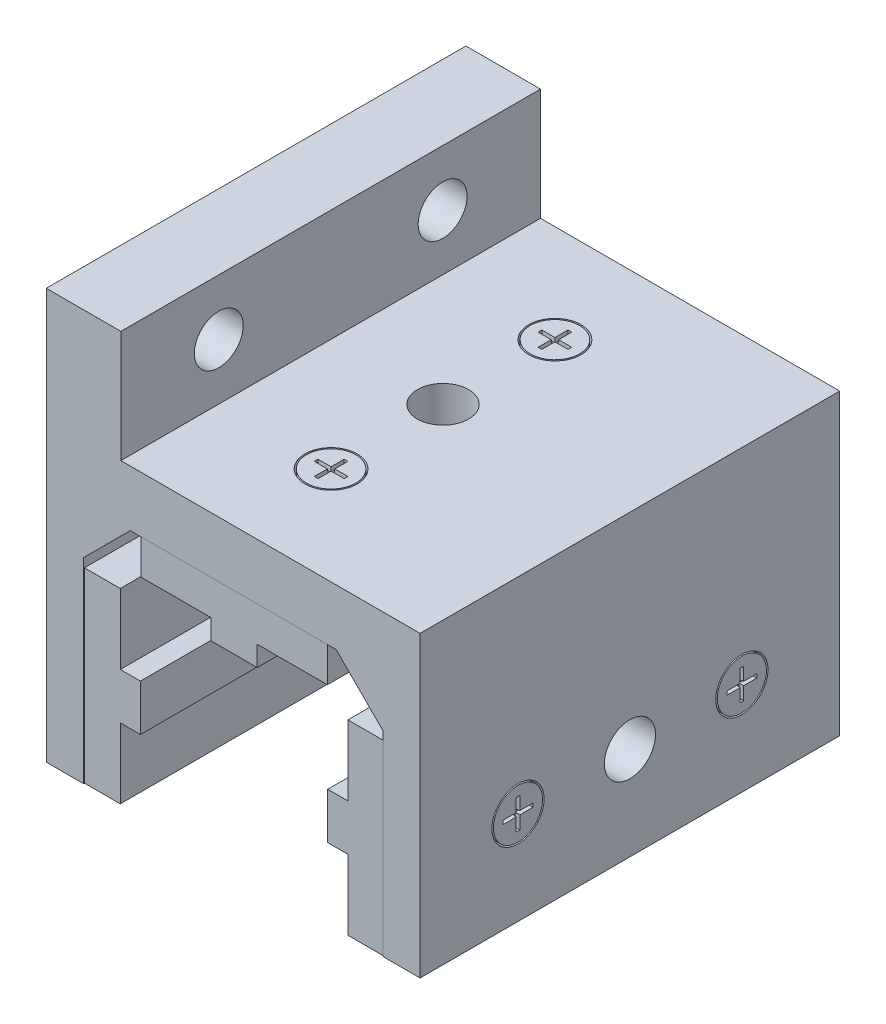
from build123d import *

# Parameters (mm, degrees)
BOSS_EXTRUDE1_DEPTH       = 35.7124
BOSS_EXTRUDE2_DEPTH       = 35.56
BOSS_EXTRUDE2_2_DEPTH     = 35.56
SKETCH11_W                = 7.874
SKETCH11_H                = 7.874
CUT_EXTRUDE5_DEPTH        = 79.334341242
SKETCH12_W                = 7.874
SKETCH12_H                = 7.874
CUT_EXTRUDE6_DEPTH        = 58.406766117
SKETCH3_R                 = 4.445
SKETCH3_R_2               = 4.191
CUT_EXTRUDE1_DEPTH        = 4.7625
CUT_EXTRUDE2_DEPTH        = 0.762
CUT_EXTRUDE2_DRAFT        = -5
SKETCH13_R                = 4.445
SKETCH13_R_2              = 4.191
CUT_EXTRUDE_THIN1_DEPTH   = 3.175
CUT_EXTRUDE7_DEPTH        = 0.762
CUT_EXTRUDE7_DRAFT        = -5
MIRROR4_COPY_1_DEPTH      = 0.762
MIRROR4_COPY_1_DRAFT      = -5
MIRROR3_COPY_1_DEPTH      = 0.762
MIRROR3_COPY_1_DRAFT      = -5
MIRROR3_COPY_2_DEPTH      = 0.762
MIRROR3_COPY_2_DRAFT      = -5
MIRROR3_COPY_3_SKETCH_R   = 4.445
MIRROR3_COPY_3_SKETCH_R_2 = 4.191
MIRROR3_COPY_3_DEPTH      = 3.175
MIRROR3_COPY_4_DEPTH      = 0.762
MIRROR3_COPY_4_DRAFT      = -5
SKETCH9_R                 = 4.3561
CUT_EXTRUDE4_DEPTH        = 70.771873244
CUT_EXTRUDE8_DEPTH        = 70.771873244
CUT_EXTRUDE8_DEPTH_BACK   = 70.771873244
SKETCH15_R                = 4.3561
SIDE_START                = -35.7124
SKETCH6_W                 = 12.7
SKETCH6_H                 = 28.575
SIDE_FLANGE_DEPTH         = 71.4248
SKETCH7_R                 = 4.1656
SIDE_FLANGE_HOLE_DEPTH    = 85.655164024
TOP_FLANGE_DEPTH          = 35.7124
TOP_FLANGE_DEPTH_BACK     = 35.7124
SKETCH16_W                = 3.175
SKETCH16_H                = 9.525


with BuildPart() as part:
    # Sketch1 → Boss-Extrude1 (new, symmetric)
    with BuildSketch(Plane.XY):
        Polygon((-25.4635, 0), (-25.4635, 33.3248), (-17.5133, 41.275), (17.5133, 41.275), (25.4635, 33.3248), (25.4635, 0), (31.8135, 0), (31.8135, 50.8), (-31.8135, 50.8), (-31.8135, 0), align=None)
    extrude(amount=BOSS_EXTRUDE1_DEPTH, both=True)

    # Sketch3 → Cut-Extrude1 (cut)
    with BuildSketch(Plane(origin=(0, 50.8, 0), x_dir=(1, 0, 0), z_dir=(0, 1, 0))):
        with Locations(Location((0, -19.05, 0), (0, 0, 270))):
            Circle(SKETCH3_R)
        with Locations(Location((0, -19.05, 0), (0, 0, 270))):
            Circle(SKETCH3_R_2, mode=Mode.SUBTRACT)
    cut_extrude1 = extrude(amount=-CUT_EXTRUDE1_DEPTH, mode=Mode.SUBTRACT)


with BuildPart() as body_2:
    # Sketch2 → Boss-Extrude2 (new, symmetric)
    with BuildSketch(Plane.XY):
        Polygon((-19.3675, 19.812), (-19.3675, 31.75), (-25.4635, 31.75), (-25.4635, 0), (-19.3675, 0), (-19.3675, 11.938), (-15.9385, 11.938), (-15.9385, 19.812), align=None)
    extrude(amount=BOSS_EXTRUDE2_DEPTH, both=True)

    # Sketch11 → Cut-Extrude5 (cut, through all)
    with BuildSketch(Plane(origin=(-15.9385, 0, 0), x_dir=(0, 0, -1), z_dir=(1, 0, 0))):
        with Locations((0, 15.875)):
            Rectangle(SKETCH11_W, SKETCH11_H)
    extrude(amount=-CUT_EXTRUDE5_DEPTH, mode=Mode.SUBTRACT)


with BuildPart() as body_3:
    # Sketch2 → Boss-Extrude2 2 (new, symmetric)
    with BuildSketch(Plane.XY):
        Polygon((-15.875, 41.275), (15.875, 41.275), (15.875, 35.179), (3.937, 35.179), (3.937, 31.75), (-3.937, 31.75), (-3.937, 35.179), (-15.875, 35.179), align=None)
    extrude(amount=BOSS_EXTRUDE2_2_DEPTH, both=True)

    # Sketch12 → Cut-Extrude6 (cut, through all)
    with BuildSketch(Plane.XZ.offset(-31.75)):
        Rectangle(SKETCH12_W, SKETCH12_H)
    extrude(amount=-CUT_EXTRUDE6_DEPTH, mode=Mode.SUBTRACT)


with BuildPart() as body_4:
    # Mirror1: mirrored copy
    add(body_2.part.mirror(Plane(origin=(0, 0, 0), x_dir=(0, 0, 1), z_dir=(1, 0, 0))))


with BuildPart() as cut_extrude2_tool:
    # Sketch5 → Cut-Extrude2 (with draft: the straight prism first)
    with BuildSketch(Plane(origin=(0, 50.8, 0), x_dir=(1, 0, 0), z_dir=(0, 1, 0))):
        Polygon((0.3175, -18.7325), (0.3175, -16.51), (-0.3175, -16.51), (-0.3175, -18.7325), (-2.54, -18.7325), (-2.54, -19.3675), (-0.3175, -19.3675), (-0.3175, -21.59), (0.3175, -21.59), (0.3175, -19.3675), (2.54, -19.3675), (2.54, -18.7325), align=None)
    extrude(amount=-CUT_EXTRUDE2_DEPTH)
    # Cut-Extrude2: the draft: its side faces are tilted about the plane it starts from
    cut_extrude2_sides = [cut_extrude2_tool.faces().sort_by_distance(p)[0] for p in [
        (0.3175, 50.419, 17.62125),
        (0, 50.419, 16.51),
        (-0.3175, 50.419, 17.62125),
        (-1.42875, 50.419, 18.7325),
        (-2.54, 50.419, 19.05),
        (-1.42875, 50.419, 19.3675),
        (-0.3175, 50.419, 20.47875),
        (0, 50.419, 21.59),
        (0.3175, 50.419, 20.47875),
        (1.42875, 50.419, 19.3675),
        (2.54, 50.419, 19.05),
        (1.42875, 50.419, 18.7325),
    ]]
    draft(cut_extrude2_sides, Plane(origin=(0, 50.8, 0), x_dir=(1, 0, 0), z_dir=(0, 1, 0)), CUT_EXTRUDE2_DRAFT)


with BuildPart() as part_1:
    add(part.part)

    # Cut-Extrude2: cut by cut_extrude2_tool
    add(cut_extrude2_tool.part, mode=Mode.SUBTRACT)

    # Sketch13 → Cut-Extrude-Thin1 (cut)
    with BuildSketch(Plane(origin=(31.8135, 0, 0), x_dir=(0, 0, -1), z_dir=(1, 0, 0))):
        with Locations((-19.05, 15.875)):
            Circle(SKETCH13_R)
        with Locations((-19.05, 15.875)):
            Circle(SKETCH13_R_2, mode=Mode.SUBTRACT)
    cut_extrude_thin1 = extrude(amount=-CUT_EXTRUDE_THIN1_DEPTH, mode=Mode.SUBTRACT)


with BuildPart() as cut_extrude7_tool:
    # Sketch14 → Cut-Extrude7 (with draft: the straight prism first)
    with BuildSketch(Plane(origin=(31.8135, 0, 0), x_dir=(0, 0, -1), z_dir=(1, 0, 0))):
        Polygon((-19.3675, 15.5575), (-19.3675, 13.335), (-18.7325, 13.335), (-18.7325, 15.5575), (-16.51, 15.5575), (-16.51, 16.1925), (-18.7325, 16.1925), (-18.7325, 18.415), (-19.3675, 18.415), (-19.3675, 16.1925), (-21.59, 16.1925), (-21.59, 15.5575), align=None)
    extrude(amount=-CUT_EXTRUDE7_DEPTH)
    # Cut-Extrude7: the draft: its side faces are tilted about the plane it starts from
    cut_extrude7_sides = [cut_extrude7_tool.faces().sort_by_distance(p)[0] for p in [
        (31.4325, 14.44625, 19.3675),
        (31.4325, 13.335, 19.05),
        (31.4325, 14.44625, 18.7325),
        (31.4325, 15.5575, 17.62125),
        (31.4325, 15.875, 16.51),
        (31.4325, 16.1925, 17.62125),
        (31.4325, 17.30375, 18.7325),
        (31.4325, 18.415, 19.05),
        (31.4325, 17.30375, 19.3675),
        (31.4325, 16.1925, 20.47875),
        (31.4325, 15.875, 21.59),
        (31.4325, 15.5575, 20.47875),
    ]]
    draft(cut_extrude7_sides, Plane(origin=(31.8135, 0, 0), x_dir=(0, 0, -1), z_dir=(1, 0, 0)), CUT_EXTRUDE7_DRAFT)


with BuildPart() as part_2:
    add(part_1.part)

    # Cut-Extrude7: cut by cut_extrude7_tool
    add(cut_extrude7_tool.part, mode=Mode.SUBTRACT)

    # Mirror4: Cut-Extrude-Thin1 across plane
    add(cut_extrude_thin1.mirror(Plane(origin=(0, 0, 0), x_dir=(0, 0, 1), z_dir=(1, 0, 0))), mode=Mode.SUBTRACT)


with BuildPart() as mirror4_copy_1_tool:
    # Mirror4 copy 1 sketch → Mirror4 copy 1 (with draft: the straight prism first)
    with BuildSketch(Plane(origin=(-31.8135, 0, 0), x_dir=(0, 0, -1), z_dir=(-1, 0, 0))):
        Polygon((-19.3675, -15.5575), (-19.3675, -13.335), (-18.7325, -13.335), (-18.7325, -15.5575), (-16.51, -15.5575), (-16.51, -16.1925), (-18.7325, -16.1925), (-18.7325, -18.415), (-19.3675, -18.415), (-19.3675, -16.1925), (-21.59, -16.1925), (-21.59, -15.5575), align=None)
    extrude(amount=-MIRROR4_COPY_1_DEPTH)
    # Mirror4 copy 1: the draft: its side faces are tilted about the plane it starts from
    mirror4_copy_1_sides = [mirror4_copy_1_tool.faces().sort_by_distance(p)[0] for p in [
        (-31.4325, 14.44625, 19.3675),
        (-31.4325, 13.335, 19.05),
        (-31.4325, 14.44625, 18.7325),
        (-31.4325, 15.5575, 17.62125),
        (-31.4325, 15.875, 16.51),
        (-31.4325, 16.1925, 17.62125),
        (-31.4325, 17.30375, 18.7325),
        (-31.4325, 18.415, 19.05),
        (-31.4325, 17.30375, 19.3675),
        (-31.4325, 16.1925, 20.47875),
        (-31.4325, 15.875, 21.59),
        (-31.4325, 15.5575, 20.47875),
    ]]
    draft(mirror4_copy_1_sides, Plane(origin=(-31.8135, 0, 0), x_dir=(0, 0, -1), z_dir=(-1, 0, 0)), MIRROR4_COPY_1_DRAFT)


with BuildPart() as part_3:
    add(part_2.part)

    # Mirror4 copy 1: cut by mirror4_copy_1_tool
    add(mirror4_copy_1_tool.part, mode=Mode.SUBTRACT)

    # Mirror3: Cut-Extrude1, Cut-Extrude-Thin1 across plane
    add(cut_extrude1.mirror(Plane.XY), mode=Mode.SUBTRACT)
    add(cut_extrude_thin1.mirror(Plane.XY), mode=Mode.SUBTRACT)


with BuildPart() as mirror3_copy_1_tool:
    # Mirror3 copy 1 sketch → Mirror3 copy 1 (with draft: the straight prism first)
    with BuildSketch(Plane(origin=(0, 50.8, 0), x_dir=(1, 0, 0), z_dir=(0, 1, 0))):
        Polygon((0.3175, 18.7325), (0.3175, 16.51), (-0.3175, 16.51), (-0.3175, 18.7325), (-2.54, 18.7325), (-2.54, 19.3675), (-0.3175, 19.3675), (-0.3175, 21.59), (0.3175, 21.59), (0.3175, 19.3675), (2.54, 19.3675), (2.54, 18.7325), align=None)
    extrude(amount=-MIRROR3_COPY_1_DEPTH)
    # Mirror3 copy 1: the draft: its side faces are tilted about the plane it starts from
    mirror3_copy_1_sides = [mirror3_copy_1_tool.faces().sort_by_distance(p)[0] for p in [
        (0.3175, 50.419, -17.62125),
        (0, 50.419, -16.51),
        (-0.3175, 50.419, -17.62125),
        (-1.42875, 50.419, -18.7325),
        (-2.54, 50.419, -19.05),
        (-1.42875, 50.419, -19.3675),
        (-0.3175, 50.419, -20.47875),
        (0, 50.419, -21.59),
        (0.3175, 50.419, -20.47875),
        (1.42875, 50.419, -19.3675),
        (2.54, 50.419, -19.05),
        (1.42875, 50.419, -18.7325),
    ]]
    draft(mirror3_copy_1_sides, Plane(origin=(0, 50.8, 0), x_dir=(1, 0, 0), z_dir=(0, 1, 0)), MIRROR3_COPY_1_DRAFT)


with BuildPart() as part_4:
    add(part_3.part)

    # Mirror3 copy 1: cut by mirror3_copy_1_tool
    add(mirror3_copy_1_tool.part, mode=Mode.SUBTRACT)


with BuildPart() as mirror3_copy_2_tool:
    # Mirror3 copy 2 sketch → Mirror3 copy 2 (with draft: the straight prism first)
    with BuildSketch(Plane(origin=(31.8135, 0, 0), x_dir=(0, 0, 1), z_dir=(1, 0, 0))):
        Polygon((-19.3675, -15.5575), (-19.3675, -13.335), (-18.7325, -13.335), (-18.7325, -15.5575), (-16.51, -15.5575), (-16.51, -16.1925), (-18.7325, -16.1925), (-18.7325, -18.415), (-19.3675, -18.415), (-19.3675, -16.1925), (-21.59, -16.1925), (-21.59, -15.5575), align=None)
    extrude(amount=-MIRROR3_COPY_2_DEPTH)
    # Mirror3 copy 2: the draft: its side faces are tilted about the plane it starts from
    mirror3_copy_2_sides = [mirror3_copy_2_tool.faces().sort_by_distance(p)[0] for p in [
        (31.4325, 14.44625, -19.3675),
        (31.4325, 13.335, -19.05),
        (31.4325, 14.44625, -18.7325),
        (31.4325, 15.5575, -17.62125),
        (31.4325, 15.875, -16.51),
        (31.4325, 16.1925, -17.62125),
        (31.4325, 17.30375, -18.7325),
        (31.4325, 18.415, -19.05),
        (31.4325, 17.30375, -19.3675),
        (31.4325, 16.1925, -20.47875),
        (31.4325, 15.875, -21.59),
        (31.4325, 15.5575, -20.47875),
    ]]
    draft(mirror3_copy_2_sides, Plane(origin=(31.8135, 0, 0), x_dir=(0, 0, 1), z_dir=(1, 0, 0)), MIRROR3_COPY_2_DRAFT)


with BuildPart() as part_5:
    add(part_4.part)

    # Mirror3 copy 2: cut by mirror3_copy_2_tool
    add(mirror3_copy_2_tool.part, mode=Mode.SUBTRACT)

    # Mirror3 copy 3 sketch → Mirror3 copy 3 (cut)
    with BuildSketch(Plane.ZY.offset(31.8135)):
        with Locations((-19.05, 15.875)):
            Circle(MIRROR3_COPY_3_SKETCH_R)
        with Locations((-19.05, 15.875)):
            Circle(MIRROR3_COPY_3_SKETCH_R_2, mode=Mode.SUBTRACT)
    extrude(amount=-MIRROR3_COPY_3_DEPTH, mode=Mode.SUBTRACT)


with BuildPart() as mirror3_copy_4_tool:
    # Mirror3 copy 4 sketch → Mirror3 copy 4 (with draft: the straight prism first)
    with BuildSketch(Plane.ZY.offset(31.8135)):
        Polygon((-19.3675, 15.5575), (-19.3675, 13.335), (-18.7325, 13.335), (-18.7325, 15.5575), (-16.51, 15.5575), (-16.51, 16.1925), (-18.7325, 16.1925), (-18.7325, 18.415), (-19.3675, 18.415), (-19.3675, 16.1925), (-21.59, 16.1925), (-21.59, 15.5575), align=None)
    extrude(amount=-MIRROR3_COPY_4_DEPTH)
    # Mirror3 copy 4: the draft: its side faces are tilted about the plane it starts from
    mirror3_copy_4_sides = [mirror3_copy_4_tool.faces().sort_by_distance(p)[0] for p in [
        (-31.4325, 14.44625, -19.3675),
        (-31.4325, 13.335, -19.05),
        (-31.4325, 14.44625, -18.7325),
        (-31.4325, 15.5575, -17.62125),
        (-31.4325, 15.875, -16.51),
        (-31.4325, 16.1925, -17.62125),
        (-31.4325, 17.30375, -18.7325),
        (-31.4325, 18.415, -19.05),
        (-31.4325, 17.30375, -19.3675),
        (-31.4325, 16.1925, -20.47875),
        (-31.4325, 15.875, -21.59),
        (-31.4325, 15.5575, -20.47875),
    ]]
    draft(mirror3_copy_4_sides, Plane.ZY.offset(31.8135), MIRROR3_COPY_4_DRAFT)


with BuildPart() as part_6:
    add(part_5.part)

    # Mirror3 copy 4: cut by mirror3_copy_4_tool
    add(mirror3_copy_4_tool.part, mode=Mode.SUBTRACT)

    # Sketch9 → Cut-Extrude4 (cut, through all)
    with BuildSketch(Plane(origin=(0, 50.8, 0), x_dir=(1, 0, 0), z_dir=(0, 1, 0))):
        with Locations(Location((0, 0, 0), (0, 0, 270))):
            Circle(SKETCH9_R)
    extrude(amount=-CUT_EXTRUDE4_DEPTH, mode=Mode.SUBTRACT)

    # Sketch15 → Cut-Extrude8 (cut, two sides: drawn at the far end of the back side and taken through both)
    with BuildSketch(Plane(origin=(0, 0, 0), x_dir=(0, 0, -1), z_dir=(1, 0, 0)).offset(-CUT_EXTRUDE8_DEPTH_BACK)):
        with Locations((0, 15.875)):
            Circle(SKETCH15_R)
    extrude(amount=CUT_EXTRUDE8_DEPTH + CUT_EXTRUDE8_DEPTH_BACK, mode=Mode.SUBTRACT)

    # Sketch6 → Side Flange (add)
    with BuildSketch(Plane.XY.offset(SIDE_START)):
        with Locations((-25.4635, 55.5625)):
            Rectangle(SKETCH6_W, SKETCH6_H)
    extrude(amount=SIDE_FLANGE_DEPTH)

    # Sketch7 → Side Flange Hole (cut, through all)
    with BuildSketch(Plane(origin=(0, 0, 0), x_dir=(0, 0, -1), z_dir=(1, 0, 0))):
        with Locations((-19.05, 60.325)):
            Circle(SKETCH7_R)
        with Locations((19.05, 60.325)):
            Circle(SKETCH7_R)
    extrude(amount=-SIDE_FLANGE_HOLE_DEPTH, mode=Mode.SUBTRACT)

    # Sketch16 → Top Flange (add, two sides: drawn at the far end of the back side and taken through both)
    with BuildSketch(Plane.XY.offset(-TOP_FLANGE_DEPTH_BACK)):
        with Locations((-30.226, 46.0375)):
            Rectangle(SKETCH16_W, SKETCH16_H)
        with Locations((30.226, 46.0375)):
            Rectangle(SKETCH16_W, SKETCH16_H)
    extrude(amount=TOP_FLANGE_DEPTH + TOP_FLANGE_DEPTH_BACK)


solid = Compound([body_2.part, body_3.part, body_4.part, part_6.part])
